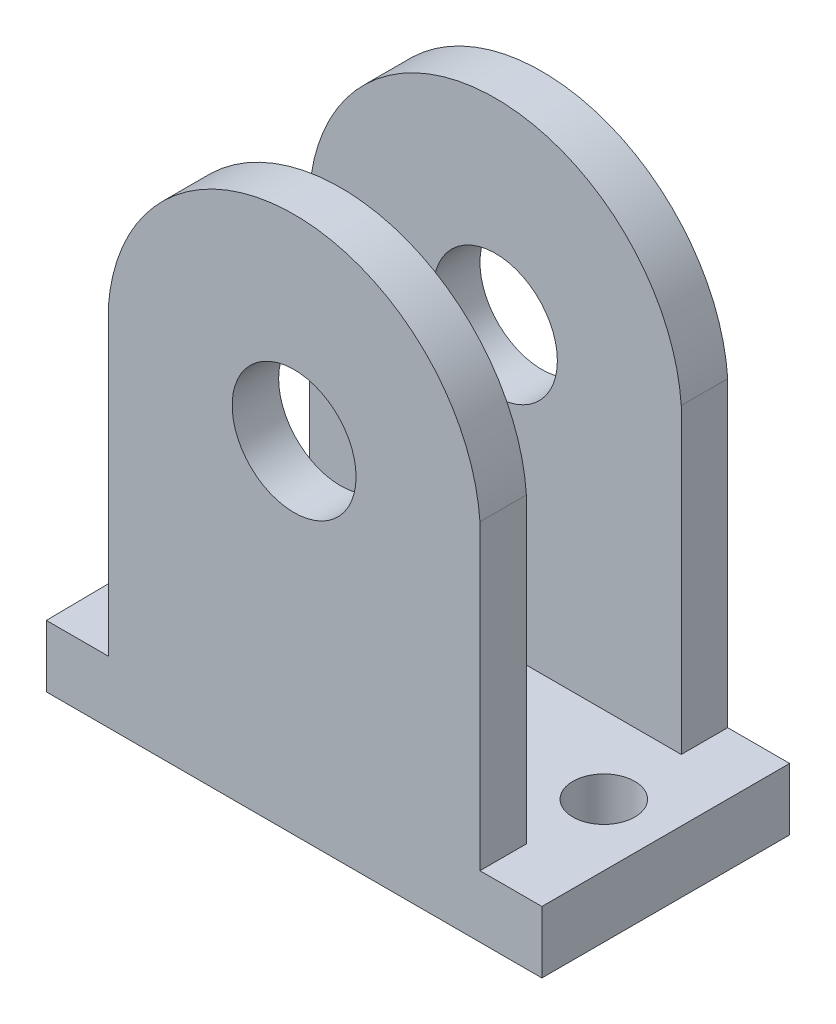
ISO-10303-21;
HEADER;
FILE_DESCRIPTION(('STEP AP214'),'2;1');
FILE_NAME('part.step','',(''),(''),'','','');
FILE_SCHEMA(('AUTOMOTIVE_DESIGN { 1 0 10303 214 1 1 1 1 }'));
ENDSEC;
DATA;
#1=APPLICATION_CONTEXT('core data for automotive mechanical design processes');
#2=APPLICATION_PROTOCOL_DEFINITION('international standard','automotive_design',2000,#1);
#3=PRODUCT_CONTEXT('',#1,'mechanical');
#4=PRODUCT('Part','Part','',(#3));
#5=PRODUCT_RELATED_PRODUCT_CATEGORY('part','',(#4));
#6=PRODUCT_DEFINITION_FORMATION('','',#4);
#7=PRODUCT_DEFINITION_CONTEXT('part definition',#1,'design');
#8=PRODUCT_DEFINITION('design','',#6,#7);
#9=PRODUCT_DEFINITION_SHAPE('','',#8);
#10=(LENGTH_UNIT() NAMED_UNIT(*) SI_UNIT(.MILLI.,.METRE.));
#11=(NAMED_UNIT(*) PLANE_ANGLE_UNIT() SI_UNIT($,.RADIAN.));
#12=(NAMED_UNIT(*) SI_UNIT($,.STERADIAN.) SOLID_ANGLE_UNIT());
#13=UNCERTAINTY_MEASURE_WITH_UNIT(LENGTH_MEASURE(1.E-05),#10,'distance_accuracy_value','');
#14=(GEOMETRIC_REPRESENTATION_CONTEXT(3) GLOBAL_UNCERTAINTY_ASSIGNED_CONTEXT((#13)) GLOBAL_UNIT_ASSIGNED_CONTEXT((#10,
#11,#12)) REPRESENTATION_CONTEXT('',''));
#15=CARTESIAN_POINT('',(0.,0.,0.));
#16=DIRECTION('',(0.,0.,1.));
#17=DIRECTION('',(1.,0.,0.));
#18=AXIS2_PLACEMENT_3D('',#15,#16,#17);
#19=CARTESIAN_POINT('',(13.2760677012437,16.5277726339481,25.4));
#20=DIRECTION('',(0.,-1.,0.));
#21=DIRECTION('',(0.,0.,-1.));
#22=AXIS2_PLACEMENT_3D('',#19,#20,#21);
#23=PLANE('',#22);
#24=CARTESIAN_POINT('',(-31.318352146,16.5277726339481,12.7));
#25=DIRECTION('',(0.,-1.,0.));
#26=DIRECTION('',(0.,0.,-1.));
#27=AXIS2_PLACEMENT_3D('',#24,#25,#26);
#28=CIRCLE('',#27,3.175);
#29=CARTESIAN_POINT('',(-31.318352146,16.5277726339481,9.525));
#30=VERTEX_POINT('',#29);
#31=EDGE_CURVE('E454',#30,#30,#28,.T.);
#32=ORIENTED_EDGE('',*,*,#31,.T.);
#33=EDGE_LOOP('',(#32));
#34=FACE_BOUND('',#33,.T.);
#35=DIRECTION('',(0.,0.,-1.));
#36=VECTOR('',#35,1.);
#37=CARTESIAN_POINT('',(6.92606770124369,16.5277726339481,25.4));
#38=LINE('',#37,#36);
#39=CARTESIAN_POINT('',(6.92606770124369,16.5277726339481,4.76249999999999));
#40=VERTEX_POINT('',#39);
#41=CARTESIAN_POINT('',(6.92606770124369,16.5277726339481,0.));
#42=VERTEX_POINT('',#41);
#43=EDGE_CURVE('E145',#40,#42,#38,.T.);
#44=ORIENTED_EDGE('',*,*,#43,.F.);
#45=DIRECTION('',(1.,0.,0.));
#46=VECTOR('',#45,1.);
#47=CARTESIAN_POINT('',(-31.1739322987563,16.5277726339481,4.7625));
#48=LINE('',#47,#46);
#49=CARTESIAN_POINT('',(-31.1739322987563,16.5277726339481,4.7625));
#50=VERTEX_POINT('',#49);
#51=EDGE_CURVE('E298',#50,#40,#48,.T.);
#52=ORIENTED_EDGE('',*,*,#51,.F.);
#53=DIRECTION('',(0.,0.,-1.));
#54=VECTOR('',#53,1.);
#55=CARTESIAN_POINT('',(-31.1739322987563,16.5277726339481,25.4));
#56=LINE('',#55,#54);
#57=CARTESIAN_POINT('',(-31.1739322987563,16.5277726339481,0.));
#58=VERTEX_POINT('',#57);
#59=EDGE_CURVE('E50',#50,#58,#56,.T.);
#60=ORIENTED_EDGE('',*,*,#59,.T.);
#61=DIRECTION('',(1.,0.,0.));
#62=VECTOR('',#61,1.);
#63=CARTESIAN_POINT('',(6.92606770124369,16.5277726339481,0.));
#64=LINE('',#63,#62);
#65=CARTESIAN_POINT('',(-37.8127720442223,16.5277726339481,0.));
#66=VERTEX_POINT('',#65);
#67=EDGE_CURVE('E187',#66,#58,#64,.T.);
#68=ORIENTED_EDGE('',*,*,#67,.F.);
#69=DIRECTION('',(-0.0113709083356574,0.,-0.999935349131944));
#70=VECTOR('',#69,1.);
#71=CARTESIAN_POINT('',(-37.5239322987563,16.5277726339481,25.4));
#72=LINE('',#71,#70);
#73=CARTESIAN_POINT('',(-37.5239322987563,16.5277726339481,25.4));
#74=VERTEX_POINT('',#73);
#75=EDGE_CURVE('E166',#74,#66,#72,.T.);
#76=ORIENTED_EDGE('',*,*,#75,.F.);
#77=DIRECTION('',(-1.,0.,0.));
#78=VECTOR('',#77,1.);
#79=CARTESIAN_POINT('',(-37.5239322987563,16.5277726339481,25.4));
#80=LINE('',#79,#78);
#81=CARTESIAN_POINT('',(-31.1739322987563,16.5277726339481,25.4));
#82=VERTEX_POINT('',#81);
#83=EDGE_CURVE('E132',#82,#74,#80,.T.);
#84=ORIENTED_EDGE('',*,*,#83,.F.);
#85=DIRECTION('',(0.,0.,-1.));
#86=VECTOR('',#85,1.);
#87=CARTESIAN_POINT('',(-31.1739322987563,16.5277726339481,25.4));
#88=LINE('',#87,#86);
#89=CARTESIAN_POINT('',(-31.1739322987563,16.5277726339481,20.6375));
#90=VERTEX_POINT('',#89);
#91=EDGE_CURVE('E219',#82,#90,#88,.T.);
#92=ORIENTED_EDGE('',*,*,#91,.T.);
#93=DIRECTION('',(-1.,0.,0.));
#94=VECTOR('',#93,1.);
#95=CARTESIAN_POINT('',(-31.1739322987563,16.5277726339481,20.6375));
#96=LINE('',#95,#94);
#97=CARTESIAN_POINT('',(6.92606770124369,16.5277726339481,20.6375));
#98=VERTEX_POINT('',#97);
#99=EDGE_CURVE('E221',#98,#90,#96,.T.);
#100=ORIENTED_EDGE('',*,*,#99,.F.);
#101=DIRECTION('',(0.,0.,-1.));
#102=VECTOR('',#101,1.);
#103=CARTESIAN_POINT('',(6.92606770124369,16.5277726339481,25.4));
#104=LINE('',#103,#102);
#105=CARTESIAN_POINT('',(6.92606770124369,16.5277726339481,25.4));
#106=VERTEX_POINT('',#105);
#107=EDGE_CURVE('E223',#106,#98,#104,.T.);
#108=ORIENTED_EDGE('',*,*,#107,.F.);
#109=CARTESIAN_POINT('',(13.2760677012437,16.5277726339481,25.4));
#110=VERTEX_POINT('',#109);
#111=EDGE_CURVE('E172',#110,#106,#80,.T.);
#112=ORIENTED_EDGE('',*,*,#111,.F.);
#113=DIRECTION('',(0.,0.,1.));
#114=VECTOR('',#113,1.);
#115=CARTESIAN_POINT('',(13.2760677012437,16.5277726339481,0.));
#116=LINE('',#115,#114);
#117=CARTESIAN_POINT('',(13.2760677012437,16.5277726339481,0.));
#118=VERTEX_POINT('',#117);
#119=EDGE_CURVE('E157',#118,#110,#116,.T.);
#120=ORIENTED_EDGE('',*,*,#119,.F.);
#121=EDGE_CURVE('E189',#42,#118,#64,.T.);
#122=ORIENTED_EDGE('',*,*,#121,.F.);
#123=EDGE_LOOP('',(#44,#52,#60,#68,#76,#84,#92,#100,#108,#112,#120,#122));
#124=FACE_BOUND('',#123,.T.);
#125=CARTESIAN_POINT('',(6.926067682,16.5277726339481,12.7));
#126=DIRECTION('',(0.,-1.,0.));
#127=DIRECTION('',(0.,0.,-1.));
#128=AXIS2_PLACEMENT_3D('',#125,#126,#127);
#129=CIRCLE('',#128,3.175);
#130=CARTESIAN_POINT('',(6.926067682,16.5277726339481,9.525));
#131=VERTEX_POINT('',#130);
#132=EDGE_CURVE('E459',#131,#131,#129,.T.);
#133=ORIENTED_EDGE('',*,*,#132,.T.);
#134=EDGE_LOOP('',(#133));
#135=FACE_BOUND('',#134,.T.);
#136=ADVANCED_FACE('F33',(#34,#124,#135),#23,.F.);
#137=CARTESIAN_POINT('',(13.2760677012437,10.1777726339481,25.4));
#138=DIRECTION('',(0.,-1.,0.));
#139=DIRECTION('',(0.,0.,-1.));
#140=AXIS2_PLACEMENT_3D('',#137,#138,#139);
#141=PLANE('',#140);
#142=CARTESIAN_POINT('',(-31.318352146,10.1777726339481,12.7));
#143=DIRECTION('',(0.,-1.,0.));
#144=DIRECTION('',(0.,0.,-1.));
#145=AXIS2_PLACEMENT_3D('',#142,#143,#144);
#146=CIRCLE('',#145,3.175);
#147=CARTESIAN_POINT('',(-31.318352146,10.1777726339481,9.525));
#148=VERTEX_POINT('',#147);
#149=EDGE_CURVE('E452',#148,#148,#146,.F.);
#150=ORIENTED_EDGE('',*,*,#149,.T.);
#151=EDGE_LOOP('',(#150));
#152=FACE_BOUND('',#151,.T.);
#153=DIRECTION('',(-1.,0.,0.));
#154=VECTOR('',#153,1.);
#155=CARTESIAN_POINT('',(-37.5239322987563,10.1777726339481,25.4));
#156=LINE('',#155,#154);
#157=CARTESIAN_POINT('',(13.2760677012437,10.1777726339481,25.4));
#158=VERTEX_POINT('',#157);
#159=CARTESIAN_POINT('',(-37.5239322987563,10.1777726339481,25.4));
#160=VERTEX_POINT('',#159);
#161=EDGE_CURVE('E153',#158,#160,#156,.T.);
#162=ORIENTED_EDGE('',*,*,#161,.T.);
#163=DIRECTION('',(-0.0113709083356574,0.,-0.999935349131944));
#164=VECTOR('',#163,1.);
#165=CARTESIAN_POINT('',(-37.5239322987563,10.1777726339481,25.4));
#166=LINE('',#165,#164);
#167=CARTESIAN_POINT('',(-37.8127720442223,10.1777726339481,0.));
#168=VERTEX_POINT('',#167);
#169=EDGE_CURVE('E156',#160,#168,#166,.T.);
#170=ORIENTED_EDGE('',*,*,#169,.T.);
#171=DIRECTION('',(1.,0.,0.));
#172=VECTOR('',#171,1.);
#173=CARTESIAN_POINT('',(-37.8127720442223,10.1777726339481,0.));
#174=LINE('',#173,#172);
#175=CARTESIAN_POINT('',(13.2760677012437,10.1777726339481,0.));
#176=VERTEX_POINT('',#175);
#177=EDGE_CURVE('E159',#168,#176,#174,.T.);
#178=ORIENTED_EDGE('',*,*,#177,.T.);
#179=DIRECTION('',(0.,0.,1.));
#180=VECTOR('',#179,1.);
#181=CARTESIAN_POINT('',(13.2760677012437,10.1777726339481,0.));
#182=LINE('',#181,#180);
#183=EDGE_CURVE('E161',#176,#158,#182,.T.);
#184=ORIENTED_EDGE('',*,*,#183,.T.);
#185=EDGE_LOOP('',(#162,#170,#178,#184));
#186=FACE_BOUND('',#185,.T.);
#187=CARTESIAN_POINT('',(6.926067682,10.1777726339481,12.7));
#188=DIRECTION('',(0.,-1.,0.));
#189=DIRECTION('',(0.,0.,-1.));
#190=AXIS2_PLACEMENT_3D('',#187,#188,#189);
#191=CIRCLE('',#190,3.175);
#192=CARTESIAN_POINT('',(6.926067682,10.1777726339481,9.525));
#193=VERTEX_POINT('',#192);
#194=EDGE_CURVE('E37',#193,#193,#191,.F.);
#195=ORIENTED_EDGE('',*,*,#194,.T.);
#196=EDGE_LOOP('',(#195));
#197=FACE_BOUND('',#196,.T.);
#198=ADVANCED_FACE('F206',(#152,#186,#197),#141,.T.);
#199=CARTESIAN_POINT('',(-31.1739322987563,16.5277726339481,25.4));
#200=DIRECTION('',(1.,0.,0.));
#201=DIRECTION('',(0.,1.,0.));
#202=AXIS2_PLACEMENT_3D('',#199,#200,#201);
#203=PLANE('',#202);
#204=DIRECTION('',(0.,-1.,0.));
#205=VECTOR('',#204,1.);
#206=CARTESIAN_POINT('',(-31.1739322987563,82.55,20.6375));
#207=LINE('',#206,#205);
#208=CARTESIAN_POINT('',(-31.1739322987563,47.5096630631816,20.6375));
#209=VERTEX_POINT('',#208);
#210=EDGE_CURVE('E178',#209,#90,#207,.T.);
#211=ORIENTED_EDGE('',*,*,#210,.T.);
#212=ORIENTED_EDGE('',*,*,#91,.F.);
#213=DIRECTION('',(0.,-1.,0.));
#214=VECTOR('',#213,1.);
#215=CARTESIAN_POINT('',(-31.1739322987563,16.5277726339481,25.4));
#216=LINE('',#215,#214);
#217=CARTESIAN_POINT('',(-31.1739322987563,47.5096630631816,25.4));
#218=VERTEX_POINT('',#217);
#219=EDGE_CURVE('E213',#218,#82,#216,.T.);
#220=ORIENTED_EDGE('',*,*,#219,.F.);
#221=DIRECTION('',(0.,0.,-1.));
#222=VECTOR('',#221,1.);
#223=CARTESIAN_POINT('',(-31.1739322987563,47.5096630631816,25.4));
#224=LINE('',#223,#222);
#225=EDGE_CURVE('E224',#218,#209,#224,.T.);
#226=ORIENTED_EDGE('',*,*,#225,.T.);
#227=EDGE_LOOP('',(#211,#212,#220,#226));
#228=FACE_BOUND('',#227,.T.);
#229=ADVANCED_FACE('F35',(#228),#203,.F.);
#230=CARTESIAN_POINT('',(6.92606770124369,47.5096630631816,25.4));
#231=DIRECTION('',(-1.,0.,0.));
#232=DIRECTION('',(0.,-1.,0.));
#233=AXIS2_PLACEMENT_3D('',#230,#231,#232);
#234=PLANE('',#233);
#235=DIRECTION('',(0.,-1.,0.));
#236=VECTOR('',#235,1.);
#237=CARTESIAN_POINT('',(6.92606770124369,82.55,20.6375));
#238=LINE('',#237,#236);
#239=CARTESIAN_POINT('',(6.92606770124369,47.5096630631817,20.6375));
#240=VERTEX_POINT('',#239);
#241=EDGE_CURVE('E11',#240,#98,#238,.T.);
#242=ORIENTED_EDGE('',*,*,#241,.F.);
#243=DIRECTION('',(0.,0.,-1.));
#244=VECTOR('',#243,1.);
#245=CARTESIAN_POINT('',(6.92606770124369,47.5096630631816,25.4));
#246=LINE('',#245,#244);
#247=CARTESIAN_POINT('',(6.92606770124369,47.5096630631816,25.4));
#248=VERTEX_POINT('',#247);
#249=EDGE_CURVE('E226',#248,#240,#246,.T.);
#250=ORIENTED_EDGE('',*,*,#249,.F.);
#251=DIRECTION('',(0.,1.,0.));
#252=VECTOR('',#251,1.);
#253=CARTESIAN_POINT('',(6.92606770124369,47.5096630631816,25.4));
#254=LINE('',#253,#252);
#255=EDGE_CURVE('E237',#106,#248,#254,.T.);
#256=ORIENTED_EDGE('',*,*,#255,.F.);
#257=ORIENTED_EDGE('',*,*,#107,.T.);
#258=EDGE_LOOP('',(#242,#250,#256,#257));
#259=FACE_BOUND('',#258,.T.);
#260=ADVANCED_FACE('F307',(#259),#234,.F.);
#261=CARTESIAN_POINT('',(-12.1239322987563,46.1748527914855,25.4));
#262=DIRECTION('',(0.,0.,-1.));
#263=DIRECTION('',(-1.,0.,0.));
#264=AXIS2_PLACEMENT_3D('',#261,#262,#263);
#265=CYLINDRICAL_SURFACE('',#264,19.0967070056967);
#266=CARTESIAN_POINT('',(-12.1239322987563,46.1748527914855,20.6375));
#267=DIRECTION('',(0.,0.,-1.));
#268=DIRECTION('',(-1.,0.,0.));
#269=AXIS2_PLACEMENT_3D('',#266,#267,#268);
#270=CIRCLE('',#269,19.0967070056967);
#271=EDGE_CURVE('E42',#209,#240,#270,.T.);
#272=ORIENTED_EDGE('',*,*,#271,.F.);
#273=ORIENTED_EDGE('',*,*,#225,.F.);
#274=CARTESIAN_POINT('',(-12.1239322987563,46.1748527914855,25.4));
#275=DIRECTION('',(0.,0.,1.));
#276=DIRECTION('',(-1.,0.,0.));
#277=AXIS2_PLACEMENT_3D('',#274,#275,#276);
#278=CIRCLE('',#277,19.0967070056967);
#279=EDGE_CURVE('E243',#248,#218,#278,.T.);
#280=ORIENTED_EDGE('',*,*,#279,.F.);
#281=ORIENTED_EDGE('',*,*,#249,.T.);
#282=EDGE_LOOP('',(#272,#273,#280,#281));
#283=FACE_BOUND('',#282,.T.);
#284=ADVANCED_FACE('F259',(#283),#265,.T.);
#285=CARTESIAN_POINT('',(-12.1239322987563,46.1748527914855,25.4));
#286=DIRECTION('',(0.,0.,-1.));
#287=DIRECTION('',(-1.,0.,0.));
#288=AXIS2_PLACEMENT_3D('',#285,#286,#287);
#289=PLANE('',#288);
#290=CARTESIAN_POINT('',(-12.123932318,45.143650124,25.4));
#291=DIRECTION('',(0.,0.,1.));
#292=DIRECTION('',(1.,0.,0.));
#293=AXIS2_PLACEMENT_3D('',#290,#291,#292);
#294=CIRCLE('',#293,6.35);
#295=CARTESIAN_POINT('',(-5.773932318,45.143650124,25.4));
#296=VERTEX_POINT('',#295);
#297=EDGE_CURVE('E292',#296,#296,#294,.T.);
#298=ORIENTED_EDGE('',*,*,#297,.F.);
#299=EDGE_LOOP('',(#298));
#300=FACE_BOUND('',#299,.T.);
#301=ORIENTED_EDGE('',*,*,#219,.T.);
#302=ORIENTED_EDGE('',*,*,#83,.T.);
#303=DIRECTION('',(0.,1.,0.));
#304=VECTOR('',#303,1.);
#305=CARTESIAN_POINT('',(-37.5239322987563,10.1777726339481,25.4));
#306=LINE('',#305,#304);
#307=EDGE_CURVE('E175',#160,#74,#306,.T.);
#308=ORIENTED_EDGE('',*,*,#307,.F.);
#309=ORIENTED_EDGE('',*,*,#161,.F.);
#310=DIRECTION('',(0.,1.,0.));
#311=VECTOR('',#310,1.);
#312=CARTESIAN_POINT('',(13.2760677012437,10.1777726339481,25.4));
#313=LINE('',#312,#311);
#314=EDGE_CURVE('E163',#158,#110,#313,.T.);
#315=ORIENTED_EDGE('',*,*,#314,.T.);
#316=ORIENTED_EDGE('',*,*,#111,.T.);
#317=ORIENTED_EDGE('',*,*,#255,.T.);
#318=ORIENTED_EDGE('',*,*,#279,.T.);
#319=EDGE_LOOP('',(#301,#302,#308,#309,#315,#316,#317,#318));
#320=FACE_BOUND('',#319,.T.);
#321=ADVANCED_FACE('F211',(#300,#320),#289,.F.);
#322=CARTESIAN_POINT('',(6.92606770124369,82.55,20.6375));
#323=DIRECTION('',(0.,0.,-1.));
#324=DIRECTION('',(-1.,0.,0.));
#325=AXIS2_PLACEMENT_3D('',#322,#323,#324);
#326=PLANE('',#325);
#327=CARTESIAN_POINT('',(-12.123932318,45.143650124,20.6375));
#328=DIRECTION('',(0.,0.,-1.));
#329=DIRECTION('',(-1.,0.,0.));
#330=AXIS2_PLACEMENT_3D('',#327,#328,#329);
#331=CIRCLE('',#330,6.35);
#332=CARTESIAN_POINT('',(-18.473932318,45.143650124,20.6375));
#333=VERTEX_POINT('',#332);
#334=EDGE_CURVE('E137',#333,#333,#331,.T.);
#335=ORIENTED_EDGE('',*,*,#334,.F.);
#336=EDGE_LOOP('',(#335));
#337=FACE_BOUND('',#336,.T.);
#338=ORIENTED_EDGE('',*,*,#99,.T.);
#339=ORIENTED_EDGE('',*,*,#210,.F.);
#340=ORIENTED_EDGE('',*,*,#271,.T.);
#341=ORIENTED_EDGE('',*,*,#241,.T.);
#342=EDGE_LOOP('',(#338,#339,#340,#341));
#343=FACE_BOUND('',#342,.T.);
#344=ADVANCED_FACE('F250',(#337,#343),#326,.T.);
#345=CARTESIAN_POINT('',(-37.5239322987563,10.1777726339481,25.4));
#346=DIRECTION('',(0.999935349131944,0.,-0.0113709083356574));
#347=DIRECTION('',(-0.0113709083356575,0.,-0.999935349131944));
#348=AXIS2_PLACEMENT_3D('',#345,#346,#347);
#349=PLANE('',#348);
#350=ORIENTED_EDGE('',*,*,#75,.T.);
#351=DIRECTION('',(0.,1.,0.));
#352=VECTOR('',#351,1.);
#353=CARTESIAN_POINT('',(-37.8127720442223,10.1777726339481,0.));
#354=LINE('',#353,#352);
#355=EDGE_CURVE('E179',#168,#66,#354,.T.);
#356=ORIENTED_EDGE('',*,*,#355,.F.);
#357=ORIENTED_EDGE('',*,*,#169,.F.);
#358=ORIENTED_EDGE('',*,*,#307,.T.);
#359=EDGE_LOOP('',(#350,#356,#357,#358));
#360=FACE_BOUND('',#359,.T.);
#361=ADVANCED_FACE('F198',(#360),#349,.F.);
#362=CARTESIAN_POINT('',(6.92606770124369,10.1777726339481,0.));
#363=DIRECTION('',(0.,0.,1.));
#364=DIRECTION('',(1.,0.,0.));
#365=AXIS2_PLACEMENT_3D('',#362,#363,#364);
#366=PLANE('',#365);
#367=CARTESIAN_POINT('',(-12.123932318,45.143650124,0.));
#368=DIRECTION('',(0.,0.,1.));
#369=DIRECTION('',(1.,0.,0.));
#370=AXIS2_PLACEMENT_3D('',#367,#368,#369);
#371=CIRCLE('',#370,6.35);
#372=CARTESIAN_POINT('',(-5.773932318,45.143650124,0.));
#373=VERTEX_POINT('',#372);
#374=EDGE_CURVE('E285',#373,#373,#371,.T.);
#375=ORIENTED_EDGE('',*,*,#374,.T.);
#376=EDGE_LOOP('',(#375));
#377=FACE_BOUND('',#376,.T.);
#378=ORIENTED_EDGE('',*,*,#67,.T.);
#379=DIRECTION('',(0.,-1.,0.));
#380=VECTOR('',#379,1.);
#381=CARTESIAN_POINT('',(-31.1739322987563,16.5277726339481,0.));
#382=LINE('',#381,#380);
#383=CARTESIAN_POINT('',(-31.1739322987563,47.5096630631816,0.));
#384=VERTEX_POINT('',#383);
#385=EDGE_CURVE('E300',#384,#58,#382,.T.);
#386=ORIENTED_EDGE('',*,*,#385,.F.);
#387=CARTESIAN_POINT('',(-12.1239322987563,46.1748527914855,0.));
#388=DIRECTION('',(0.,0.,1.));
#389=DIRECTION('',(-1.,0.,0.));
#390=AXIS2_PLACEMENT_3D('',#387,#388,#389);
#391=CIRCLE('',#390,19.0967070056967);
#392=CARTESIAN_POINT('',(6.92606770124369,47.5096630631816,0.));
#393=VERTEX_POINT('',#392);
#394=EDGE_CURVE('E141',#393,#384,#391,.T.);
#395=ORIENTED_EDGE('',*,*,#394,.F.);
#396=DIRECTION('',(0.,1.,0.));
#397=VECTOR('',#396,1.);
#398=CARTESIAN_POINT('',(6.92606770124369,47.5096630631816,0.));
#399=LINE('',#398,#397);
#400=EDGE_CURVE('E147',#42,#393,#399,.T.);
#401=ORIENTED_EDGE('',*,*,#400,.F.);
#402=ORIENTED_EDGE('',*,*,#121,.T.);
#403=DIRECTION('',(0.,1.,0.));
#404=VECTOR('',#403,1.);
#405=CARTESIAN_POINT('',(13.2760677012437,10.1777726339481,0.));
#406=LINE('',#405,#404);
#407=EDGE_CURVE('E182',#176,#118,#406,.T.);
#408=ORIENTED_EDGE('',*,*,#407,.F.);
#409=ORIENTED_EDGE('',*,*,#177,.F.);
#410=ORIENTED_EDGE('',*,*,#355,.T.);
#411=EDGE_LOOP('',(#378,#386,#395,#401,#402,#408,#409,#410));
#412=FACE_BOUND('',#411,.T.);
#413=ADVANCED_FACE('F203',(#377,#412),#366,.F.);
#414=CARTESIAN_POINT('',(13.2760677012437,10.1777726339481,0.));
#415=DIRECTION('',(-1.,0.,0.));
#416=DIRECTION('',(0.,0.,1.));
#417=AXIS2_PLACEMENT_3D('',#414,#415,#416);
#418=PLANE('',#417);
#419=ORIENTED_EDGE('',*,*,#119,.T.);
#420=ORIENTED_EDGE('',*,*,#314,.F.);
#421=ORIENTED_EDGE('',*,*,#183,.F.);
#422=ORIENTED_EDGE('',*,*,#407,.T.);
#423=EDGE_LOOP('',(#419,#420,#421,#422));
#424=FACE_BOUND('',#423,.T.);
#425=ADVANCED_FACE('F275',(#424),#418,.F.);
#426=CARTESIAN_POINT('',(-12.1239322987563,46.1748527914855,25.4));
#427=DIRECTION('',(0.,0.,-1.));
#428=DIRECTION('',(-1.,0.,0.));
#429=AXIS2_PLACEMENT_3D('',#426,#427,#428);
#430=CYLINDRICAL_SURFACE('',#429,19.0967070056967);
#431=CARTESIAN_POINT('',(-12.1239322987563,46.1748527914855,4.7625));
#432=DIRECTION('',(0.,0.,1.));
#433=DIRECTION('',(1.,0.,0.));
#434=AXIS2_PLACEMENT_3D('',#431,#432,#433);
#435=CIRCLE('',#434,19.0967070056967);
#436=CARTESIAN_POINT('',(6.92606770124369,47.5096630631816,4.7625));
#437=VERTEX_POINT('',#436);
#438=CARTESIAN_POINT('',(-31.1739322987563,47.5096630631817,4.76249999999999));
#439=VERTEX_POINT('',#438);
#440=EDGE_CURVE('E123',#437,#439,#435,.T.);
#441=ORIENTED_EDGE('',*,*,#440,.F.);
#442=DIRECTION('',(0.,0.,-1.));
#443=VECTOR('',#442,1.);
#444=CARTESIAN_POINT('',(6.92606770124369,47.5096630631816,25.4));
#445=LINE('',#444,#443);
#446=EDGE_CURVE('E143',#437,#393,#445,.T.);
#447=ORIENTED_EDGE('',*,*,#446,.T.);
#448=ORIENTED_EDGE('',*,*,#394,.T.);
#449=DIRECTION('',(0.,0.,-1.));
#450=VECTOR('',#449,1.);
#451=CARTESIAN_POINT('',(-31.1739322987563,47.5096630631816,25.4));
#452=LINE('',#451,#450);
#453=EDGE_CURVE('E135',#439,#384,#452,.T.);
#454=ORIENTED_EDGE('',*,*,#453,.F.);
#455=EDGE_LOOP('',(#441,#447,#448,#454));
#456=FACE_BOUND('',#455,.T.);
#457=ADVANCED_FACE('F139',(#456),#430,.T.);
#458=CARTESIAN_POINT('',(6.92606770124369,47.5096630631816,25.4));
#459=DIRECTION('',(-1.,0.,0.));
#460=DIRECTION('',(0.,-1.,0.));
#461=AXIS2_PLACEMENT_3D('',#458,#459,#460);
#462=PLANE('',#461);
#463=DIRECTION('',(0.,-1.,0.));
#464=VECTOR('',#463,1.);
#465=CARTESIAN_POINT('',(6.92606770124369,82.55,4.76249999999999));
#466=LINE('',#465,#464);
#467=EDGE_CURVE('E128',#437,#40,#466,.T.);
#468=ORIENTED_EDGE('',*,*,#467,.T.);
#469=ORIENTED_EDGE('',*,*,#43,.T.);
#470=ORIENTED_EDGE('',*,*,#400,.T.);
#471=ORIENTED_EDGE('',*,*,#446,.F.);
#472=EDGE_LOOP('',(#468,#469,#470,#471));
#473=FACE_BOUND('',#472,.T.);
#474=ADVANCED_FACE('F303',(#473),#462,.F.);
#475=CARTESIAN_POINT('',(-31.1739322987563,16.5277726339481,25.4));
#476=DIRECTION('',(1.,0.,0.));
#477=DIRECTION('',(0.,1.,0.));
#478=AXIS2_PLACEMENT_3D('',#475,#476,#477);
#479=PLANE('',#478);
#480=DIRECTION('',(0.,-1.,0.));
#481=VECTOR('',#480,1.);
#482=CARTESIAN_POINT('',(-31.1739322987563,82.55,4.76249999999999));
#483=LINE('',#482,#481);
#484=EDGE_CURVE('E125',#439,#50,#483,.T.);
#485=ORIENTED_EDGE('',*,*,#484,.F.);
#486=ORIENTED_EDGE('',*,*,#453,.T.);
#487=ORIENTED_EDGE('',*,*,#385,.T.);
#488=ORIENTED_EDGE('',*,*,#59,.F.);
#489=EDGE_LOOP('',(#485,#486,#487,#488));
#490=FACE_BOUND('',#489,.T.);
#491=ADVANCED_FACE('F134',(#490),#479,.F.);
#492=CARTESIAN_POINT('',(-31.1739322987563,82.55,4.76249999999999));
#493=DIRECTION('',(0.,0.,1.));
#494=DIRECTION('',(1.,0.,0.));
#495=AXIS2_PLACEMENT_3D('',#492,#493,#494);
#496=PLANE('',#495);
#497=CARTESIAN_POINT('',(-12.123932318,45.143650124,4.7625));
#498=DIRECTION('',(0.,0.,1.));
#499=DIRECTION('',(1.,0.,0.));
#500=AXIS2_PLACEMENT_3D('',#497,#498,#499);
#501=CIRCLE('',#500,6.35);
#502=CARTESIAN_POINT('',(-5.773932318,45.143650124,4.7625));
#503=VERTEX_POINT('',#502);
#504=EDGE_CURVE('E287',#503,#503,#501,.T.);
#505=ORIENTED_EDGE('',*,*,#504,.F.);
#506=EDGE_LOOP('',(#505));
#507=FACE_BOUND('',#506,.T.);
#508=ORIENTED_EDGE('',*,*,#51,.T.);
#509=ORIENTED_EDGE('',*,*,#467,.F.);
#510=ORIENTED_EDGE('',*,*,#440,.T.);
#511=ORIENTED_EDGE('',*,*,#484,.T.);
#512=EDGE_LOOP('',(#508,#509,#510,#511));
#513=FACE_BOUND('',#512,.T.);
#514=ADVANCED_FACE('F124',(#507,#513),#496,.T.);
#515=CARTESIAN_POINT('',(-12.123932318,45.143650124,-15.494));
#516=DIRECTION('',(0.,0.,1.));
#517=DIRECTION('',(1.,0.,0.));
#518=AXIS2_PLACEMENT_3D('',#515,#516,#517);
#519=CYLINDRICAL_SURFACE('',#518,6.35);
#520=ORIENTED_EDGE('',*,*,#504,.T.);
#521=EDGE_LOOP('',(#520));
#522=FACE_BOUND('',#521,.T.);
#523=ORIENTED_EDGE('',*,*,#374,.F.);
#524=EDGE_LOOP('',(#523));
#525=FACE_BOUND('',#524,.T.);
#526=ADVANCED_FACE('F355',(#522,#525),#519,.F.);
#527=ORIENTED_EDGE('',*,*,#334,.T.);
#528=EDGE_LOOP('',(#527));
#529=FACE_BOUND('',#528,.T.);
#530=ORIENTED_EDGE('',*,*,#297,.T.);
#531=EDGE_LOOP('',(#530));
#532=FACE_BOUND('',#531,.T.);
#533=ADVANCED_FACE('F337',(#529,#532),#519,.F.);
#534=CARTESIAN_POINT('',(-31.318352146,6.36777263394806,12.7));
#535=DIRECTION('',(0.,1.,0.));
#536=DIRECTION('',(0.,0.,1.));
#537=AXIS2_PLACEMENT_3D('',#534,#535,#536);
#538=CYLINDRICAL_SURFACE('',#537,3.175);
#539=ORIENTED_EDGE('',*,*,#149,.F.);
#540=EDGE_LOOP('',(#539));
#541=FACE_BOUND('',#540,.T.);
#542=ORIENTED_EDGE('',*,*,#31,.F.);
#543=EDGE_LOOP('',(#542));
#544=FACE_BOUND('',#543,.T.);
#545=ADVANCED_FACE('F331',(#541,#544),#538,.F.);
#546=CARTESIAN_POINT('',(6.926067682,6.36777263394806,12.7));
#547=DIRECTION('',(0.,1.,0.));
#548=DIRECTION('',(0.,0.,1.));
#549=AXIS2_PLACEMENT_3D('',#546,#547,#548);
#550=CYLINDRICAL_SURFACE('',#549,3.175);
#551=ORIENTED_EDGE('',*,*,#194,.F.);
#552=EDGE_LOOP('',(#551));
#553=FACE_BOUND('',#552,.T.);
#554=ORIENTED_EDGE('',*,*,#132,.F.);
#555=EDGE_LOOP('',(#554));
#556=FACE_BOUND('',#555,.T.);
#557=ADVANCED_FACE('F336',(#553,#556),#550,.F.);
#558=CLOSED_SHELL('',(#136,#198,#229,#260,#284,#321,#344,#361,#413,#425,#457,#474,#491,#514,
#526,#533,#545,#557));
#559=MANIFOLD_SOLID_BREP('B2',#558);
#560=ADVANCED_BREP_SHAPE_REPRESENTATION('',(#18,#559),#14);
#561=SHAPE_DEFINITION_REPRESENTATION(#9,#560);
ENDSEC;
END-ISO-10303-21;
